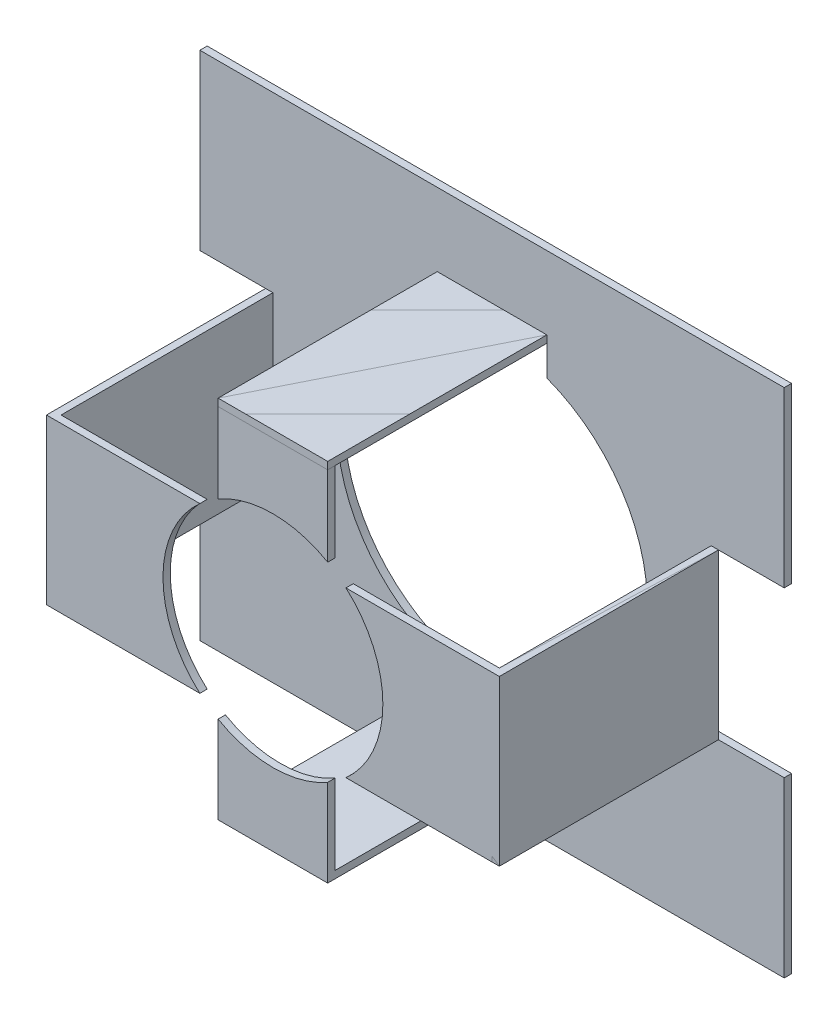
from build123d import *

# Parameters (mm, degrees)
EXTRUSION1_DEPTH        = 0.2
ESQUISSE2_W             = 0.2
ESQUISSE2_H             = 4.5
EXTRUSION2_DEPTH        = 6
ESQUISSE2_W_2           = 3
ESQUISSE2_H_2           = 0.2
EXTRUSION2_2_DEPTH      = 6
EXTRUSION2_3_DEPTH      = 6
EXTRUSION2_4_DEPTH      = 6
ESQUISSE3_W             = 0.2
ESQUISSE3_H             = 4.5
EXTRUSION5_DEPTH        = 4
ESQUISSE4_W             = 3
ESQUISSE4_H             = 0.2
EXTRUSION6_DEPTH        = 4
ESQUISSE5_R             = 3.010398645
ENL_V_MAT_EXTRU_1_DEPTH = 4


with BuildPart() as part:
    # Esquisse1 → Extrusion1 (new body)
    with BuildSketch(Plane.XY):
        Polygon((-8, 7), (8, 7), (8, 2.25), (6, 2.25), (6, -2.25), (8, -2.25), (8, -7), (-8, -7), (-8, -2.25), (-6, -2.25), (-6, 2.25), (-8, 2.25), align=None)
        with BuildLine():
            Line((-1.5, 3.97649343), (-1.5, 5))
            Line((-1.5, 5), (1.5, 5))
            Line((1.5, 5), (1.5, 3.97649343))
            ThreePointArc((1.5, 3.97649343), (4.25, 0), (1.5, -3.97649343))
            Line((1.5, -3.97649343), (1.5, -5))
            Line((1.5, -5), (-1.5, -5))
            Line((-1.5, -5), (-1.5, -3.97649343))
            ThreePointArc((-1.5, -3.97649343), (-4.25, 0), (-1.5, 3.97649343))
        make_face(mode=Mode.SUBTRACT)
    extrude(amount=EXTRUSION1_DEPTH)


with BuildPart() as body_2:
    # Esquisse2 → Extrusion2 (new body)
    with BuildSketch(Plane.XY.offset(0.2)):
        with Locations((-6.1, 0)):
            Rectangle(ESQUISSE2_W, ESQUISSE2_H)
    extrude(amount=EXTRUSION2_DEPTH)

    # Esquisse3 → Extrusion5 (add)
    with BuildSketch(Plane(origin=(-6, 0, 0), x_dir=(0, 0, -1), z_dir=(1, 0, 0))):
        with Locations((-6.1, 0)):
            Rectangle(ESQUISSE3_W, ESQUISSE3_H)
    extrude(amount=EXTRUSION5_DEPTH)


with BuildPart() as body_3:
    # Esquisse2 → Extrusion2 2 (new body)
    with BuildSketch(Plane.XY.offset(0.2)):
        with Locations((0, 4.9)):
            Rectangle(ESQUISSE2_W_2, ESQUISSE2_H_2)
    extrude(amount=EXTRUSION2_2_DEPTH)


with BuildPart() as body_4:
    # Esquisse2 → Extrusion2 3 (new body)
    with BuildSketch(Plane.XY.offset(0.2)):
        with Locations((6.1, 0)):
            Rectangle(ESQUISSE2_W, ESQUISSE2_H)
    extrude(amount=EXTRUSION2_3_DEPTH)


with BuildPart() as body_5:
    # Esquisse2 → Extrusion2 4 (new body)
    with BuildSketch(Plane.XY.offset(0.2)):
        with Locations((0, -4.9)):
            Rectangle(ESQUISSE2_W_2, ESQUISSE2_H_2)
    extrude(amount=EXTRUSION2_4_DEPTH)

    # Esquisse4 → Extrusion6 (add)
    with BuildSketch(Plane(origin=(0, -4.8, 0), x_dir=(-1, 0, 0), z_dir=(0, 1, 0))):
        with Locations((0, 6.1)):
            Rectangle(ESQUISSE4_W, ESQUISSE4_H)
    extrude(amount=EXTRUSION6_DEPTH)


with BuildPart() as body_6:
    # Sym_trie4: mirrored copy
    add(body_2.part.mirror(Plane(origin=(0, 0, 0), x_dir=(0, 0, 1), z_dir=(1, 0, 0))))


with BuildPart() as body_7:
    # Sym_trie6: mirrored copy
    add(body_5.part.mirror(Plane.ZX))


with BuildPart() as enl_v_mat_extru_1_tool:
    # Esquisse5 → Enl_v. mat.-Extru.1 (new body)
    with BuildSketch(Plane.XY.offset(6.2)):
        Circle(ESQUISSE5_R)
    extrude(amount=-ENL_V_MAT_EXTRU_1_DEPTH)


with BuildPart() as body_2_1:
    add(body_2.part)

    # Enl_v. mat.-Extru.1: cut by enl_v_mat_extru_1_tool
    add(enl_v_mat_extru_1_tool.part, mode=Mode.SUBTRACT)


with BuildPart() as body_5_1:
    add(body_5.part)

    # Enl_v. mat.-Extru.1: cut by enl_v_mat_extru_1_tool
    add(enl_v_mat_extru_1_tool.part, mode=Mode.SUBTRACT)


with BuildPart() as body_6_1:
    add(body_6.part)

    # Enl_v. mat.-Extru.1: cut by enl_v_mat_extru_1_tool
    add(enl_v_mat_extru_1_tool.part, mode=Mode.SUBTRACT)


with BuildPart() as body_7_1:
    add(body_7.part)

    # Enl_v. mat.-Extru.1: cut by enl_v_mat_extru_1_tool
    add(enl_v_mat_extru_1_tool.part, mode=Mode.SUBTRACT)


solid = Compound([part.part, body_3.part, body_4.part, body_2_1.part, body_5_1.part, body_6_1.part, body_7_1.part])
